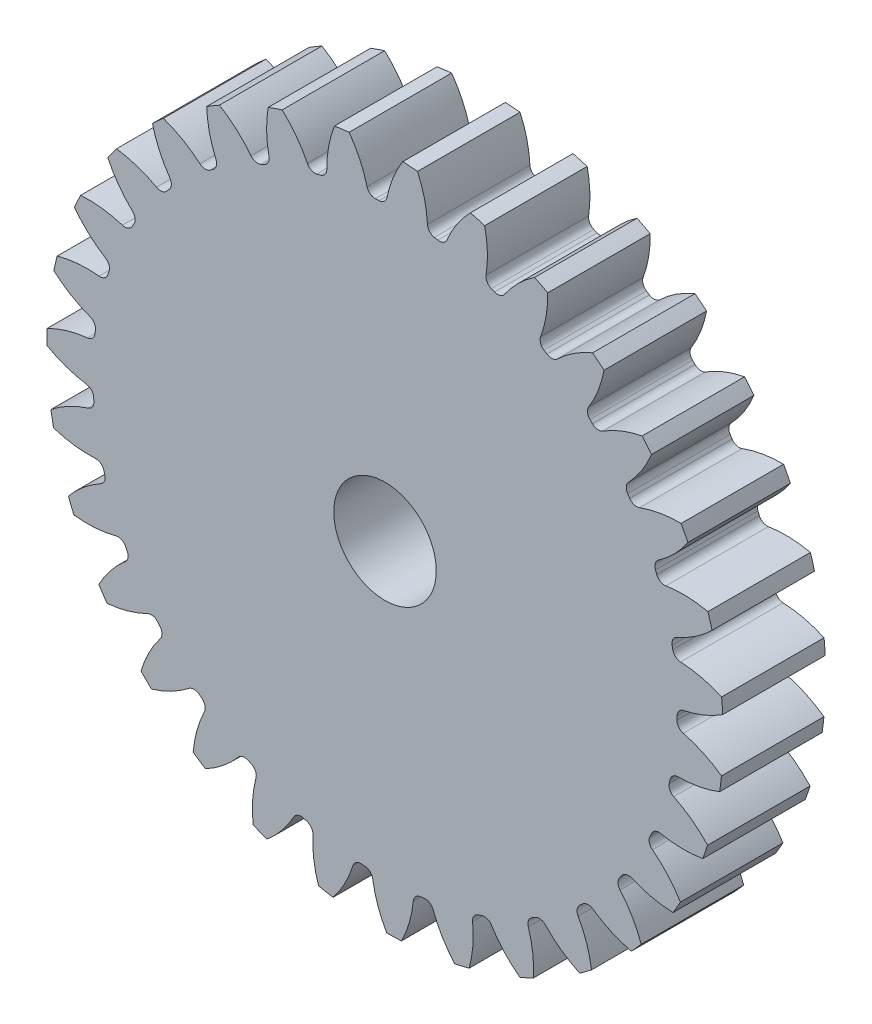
from build123d import *

# Parameters (mm, degrees)
SKETCH3_R         = 335.28
GEARBODY_DEPTH    = 101.6
TOOTHCUT_DEPTH    = 485.920526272
CIRPATTERN1_COUNT = 31
BOREDIA_R         = 50.8
BORE_DEPTH        = 12700


with BuildPart() as part:
    # Sketch3 → gearBody (new body)
    with BuildSketch(Plane.XY):
        Circle(SKETCH3_R)
    extrude(amount=GEARBODY_DEPTH)

    # Sketch2 → toothCut (cut, through all)
    with BuildSketch(Plane.XY):
        with BuildLine():
            ThreePointArc((289.43003622, -8.674545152), (289.477614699, -6.906821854), (289.514396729, -5.138840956))
            ThreePointArc((289.514396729, -5.138840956), (291.420723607, -0.002238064), (296.119543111, 2.815538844))
            ThreePointArc((296.119543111, 2.815538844), (316.466034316, 9.044000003), (335.28, 18.984227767))
            ThreePointArc((335.28, 18.984227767), (335.721486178, -8.01018241), (333.99308329, -34.952819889))
            ThreePointArc((333.99308329, -34.952819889), (315.674596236, -24.126626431), (295.64830574, -16.934886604))
            ThreePointArc((295.64830574, -16.934886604), (291.089218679, -13.896219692), (289.43003622, -8.674545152))
        make_face()
    toothcut = extrude(amount=TOOTHCUT_DEPTH, mode=Mode.SUBTRACT)

    # CirPattern1: toothCut ×31 about axis
    cirpattern1_axis = Axis((0, 0, 0), (0, 0, 1))
    for i in range(1, CIRPATTERN1_COUNT):
        add(toothcut.rotate(cirpattern1_axis, i * 360 / CIRPATTERN1_COUNT), mode=Mode.SUBTRACT)

    # boreDia → bore (cut, symmetric)
    with BuildSketch(Plane.XY):
        Circle(BOREDIA_R)
    extrude(amount=BORE_DEPTH, both=True, mode=Mode.SUBTRACT)


solid = part.part
